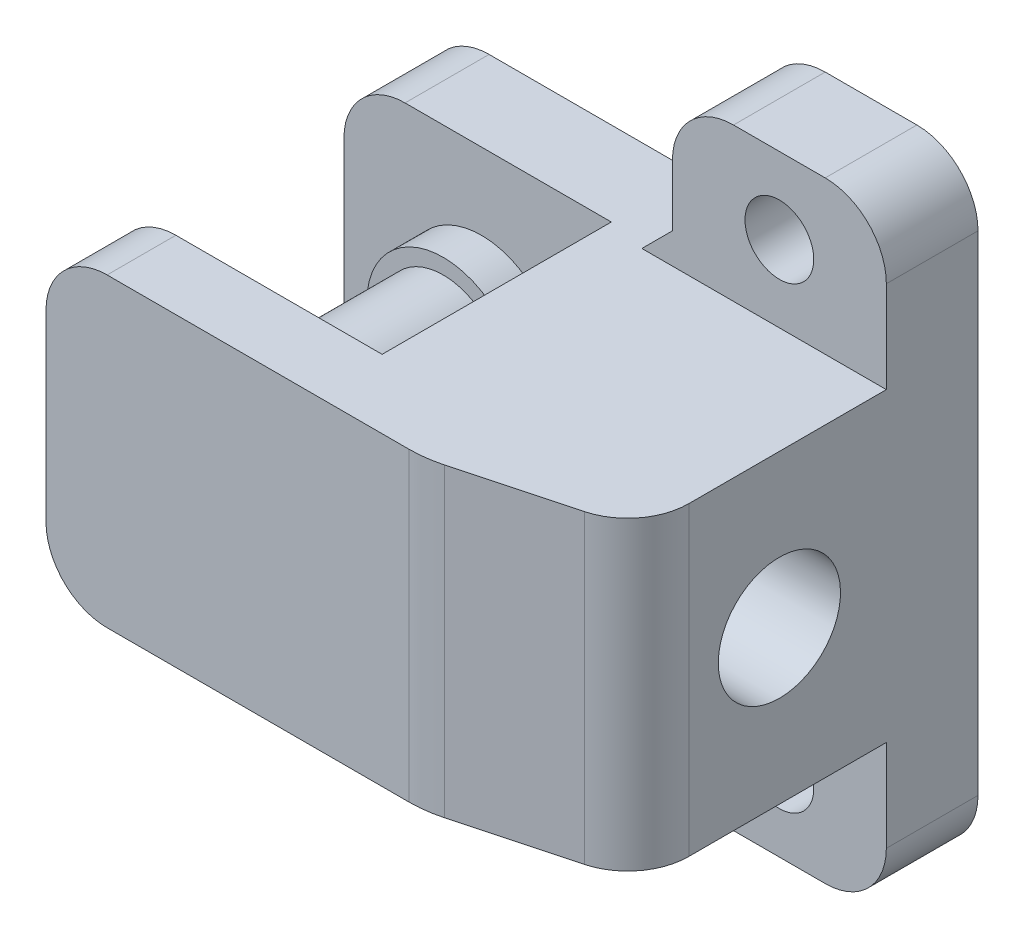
ISO-10303-21;
HEADER;
FILE_DESCRIPTION(('STEP AP214'),'2;1');
FILE_NAME('part.step','',(''),(''),'','','');
FILE_SCHEMA(('AUTOMOTIVE_DESIGN { 1 0 10303 214 1 1 1 1 }'));
ENDSEC;
DATA;
#1=APPLICATION_CONTEXT('core data for automotive mechanical design processes');
#2=APPLICATION_PROTOCOL_DEFINITION('international standard','automotive_design',2000,#1);
#3=PRODUCT_CONTEXT('',#1,'mechanical');
#4=PRODUCT('Part','Part','',(#3));
#5=PRODUCT_RELATED_PRODUCT_CATEGORY('part','',(#4));
#6=PRODUCT_DEFINITION_FORMATION('','',#4);
#7=PRODUCT_DEFINITION_CONTEXT('part definition',#1,'design');
#8=PRODUCT_DEFINITION('design','',#6,#7);
#9=PRODUCT_DEFINITION_SHAPE('','',#8);
#10=(LENGTH_UNIT() NAMED_UNIT(*) SI_UNIT(.MILLI.,.METRE.));
#11=(NAMED_UNIT(*) PLANE_ANGLE_UNIT() SI_UNIT($,.RADIAN.));
#12=(NAMED_UNIT(*) SI_UNIT($,.STERADIAN.) SOLID_ANGLE_UNIT());
#13=UNCERTAINTY_MEASURE_WITH_UNIT(LENGTH_MEASURE(1.E-05),#10,'distance_accuracy_value','');
#14=(GEOMETRIC_REPRESENTATION_CONTEXT(3) GLOBAL_UNCERTAINTY_ASSIGNED_CONTEXT((#13)) GLOBAL_UNIT_ASSIGNED_CONTEXT((#10,
#11,#12)) REPRESENTATION_CONTEXT('',''));
#15=CARTESIAN_POINT('',(0.,0.,0.));
#16=DIRECTION('',(0.,0.,1.));
#17=DIRECTION('',(1.,0.,0.));
#18=AXIS2_PLACEMENT_3D('',#15,#16,#17);
#19=CARTESIAN_POINT('',(-20.,15.,8.));
#20=DIRECTION('',(0.,0.,-1.));
#21=DIRECTION('',(-1.,0.,0.));
#22=AXIS2_PLACEMENT_3D('',#19,#20,#21);
#23=CYLINDRICAL_SURFACE('',#22,4.);
#24=CARTESIAN_POINT('',(-20.,15.,18.));
#25=DIRECTION('',(0.,0.,-1.));
#26=DIRECTION('',(-1.,0.,0.));
#27=AXIS2_PLACEMENT_3D('',#24,#25,#26);
#28=CIRCLE('',#27,4.);
#29=CARTESIAN_POINT('',(-24.,15.,18.));
#30=VERTEX_POINT('',#29);
#31=EDGE_CURVE('E18',#30,#30,#28,.F.);
#32=ORIENTED_EDGE('',*,*,#31,.F.);
#33=EDGE_LOOP('',(#32));
#34=FACE_BOUND('',#33,.T.);
#35=CARTESIAN_POINT('',(-20.,15.,8.));
#36=DIRECTION('',(0.,0.,-1.));
#37=DIRECTION('',(-1.,0.,0.));
#38=AXIS2_PLACEMENT_3D('',#35,#36,#37);
#39=CIRCLE('',#38,4.);
#40=CARTESIAN_POINT('',(-24.,15.,8.));
#41=VERTEX_POINT('',#40);
#42=EDGE_CURVE('E225',#41,#41,#39,.T.);
#43=ORIENTED_EDGE('',*,*,#42,.F.);
#44=EDGE_LOOP('',(#43));
#45=FACE_BOUND('',#44,.T.);
#46=ADVANCED_FACE('F14',(#34,#45),#23,.T.);
#47=CARTESIAN_POINT('',(-20.,15.,18.));
#48=DIRECTION('',(0.,0.,1.));
#49=DIRECTION('',(1.,0.,0.));
#50=AXIS2_PLACEMENT_3D('',#47,#48,#49);
#51=PLANE('',#50);
#52=ORIENTED_EDGE('',*,*,#31,.T.);
#53=EDGE_LOOP('',(#52));
#54=FACE_BOUND('',#53,.T.);
#55=CARTESIAN_POINT('',(-20.,15.,18.));
#56=DIRECTION('',(0.,0.,-1.));
#57=DIRECTION('',(-1.,0.,0.));
#58=AXIS2_PLACEMENT_3D('',#55,#56,#57);
#59=CIRCLE('',#58,5.);
#60=CARTESIAN_POINT('',(-25.,15.,18.));
#61=VERTEX_POINT('',#60);
#62=EDGE_CURVE('E355',#61,#61,#59,.F.);
#63=ORIENTED_EDGE('',*,*,#62,.F.);
#64=EDGE_LOOP('',(#63));
#65=FACE_BOUND('',#64,.T.);
#66=ADVANCED_FACE('F930',(#54,#65),#51,.F.);
#67=CARTESIAN_POINT('',(-7.,27.,6.));
#68=DIRECTION('',(-1.,0.,0.));
#69=DIRECTION('',(0.,-1.,0.));
#70=AXIS2_PLACEMENT_3D('',#67,#68,#69);
#71=PLANE('',#70);
#72=DIRECTION('',(0.,1.,0.));
#73=VECTOR('',#72,1.);
#74=CARTESIAN_POINT('',(-7.,5.,0.));
#75=LINE('',#74,#73);
#76=CARTESIAN_POINT('',(-7.,27.,0.));
#77=VERTEX_POINT('',#76);
#78=CARTESIAN_POINT('',(-7.,31.,0.));
#79=VERTEX_POINT('',#78);
#80=EDGE_CURVE('E332',#77,#79,#75,.T.);
#81=ORIENTED_EDGE('',*,*,#80,.F.);
#82=DIRECTION('',(0.,0.,1.));
#83=VECTOR('',#82,1.);
#84=CARTESIAN_POINT('',(-7.,27.,6.));
#85=LINE('',#84,#83);
#86=CARTESIAN_POINT('',(-7.,27.,6.));
#87=VERTEX_POINT('',#86);
#88=EDGE_CURVE('E403',#87,#77,#85,.F.);
#89=ORIENTED_EDGE('',*,*,#88,.F.);
#90=DIRECTION('',(0.,1.,0.));
#91=VECTOR('',#90,1.);
#92=CARTESIAN_POINT('',(-7.,25.,6.));
#93=LINE('',#92,#91);
#94=CARTESIAN_POINT('',(-7.,31.,6.));
#95=VERTEX_POINT('',#94);
#96=EDGE_CURVE('E345',#95,#87,#93,.F.);
#97=ORIENTED_EDGE('',*,*,#96,.F.);
#98=DIRECTION('',(0.,0.,1.));
#99=VECTOR('',#98,1.);
#100=CARTESIAN_POINT('',(-7.,31.,3.));
#101=LINE('',#100,#99);
#102=EDGE_CURVE('E247',#79,#95,#101,.T.);
#103=ORIENTED_EDGE('',*,*,#102,.F.);
#104=EDGE_LOOP('',(#81,#89,#97,#103));
#105=FACE_BOUND('',#104,.T.);
#106=ADVANCED_FACE('F560',(#105),#71,.T.);
#107=CARTESIAN_POINT('',(-3.,31.,0.));
#108=DIRECTION('',(0.,0.,-1.));
#109=DIRECTION('',(-1.,0.,0.));
#110=AXIS2_PLACEMENT_3D('',#107,#108,#109);
#111=CYLINDRICAL_SURFACE('',#110,4.);
#112=CARTESIAN_POINT('',(-3.,31.,0.));
#113=DIRECTION('',(0.,0.,-1.));
#114=DIRECTION('',(-1.,0.,0.));
#115=AXIS2_PLACEMENT_3D('',#112,#113,#114);
#116=CIRCLE('',#115,4.);
#117=CARTESIAN_POINT('',(-3.,35.,0.));
#118=VERTEX_POINT('',#117);
#119=EDGE_CURVE('E329',#79,#118,#116,.T.);
#120=ORIENTED_EDGE('',*,*,#119,.F.);
#121=ORIENTED_EDGE('',*,*,#102,.T.);
#122=CARTESIAN_POINT('',(-3.,31.,6.));
#123=DIRECTION('',(0.,0.,-1.));
#124=DIRECTION('',(-1.,0.,0.));
#125=AXIS2_PLACEMENT_3D('',#122,#123,#124);
#126=CIRCLE('',#125,4.);
#127=CARTESIAN_POINT('',(-3.,35.,6.));
#128=VERTEX_POINT('',#127);
#129=EDGE_CURVE('E342',#128,#95,#126,.F.);
#130=ORIENTED_EDGE('',*,*,#129,.F.);
#131=DIRECTION('',(0.,0.,1.));
#132=VECTOR('',#131,1.);
#133=CARTESIAN_POINT('',(-3.,35.,6.));
#134=LINE('',#133,#132);
#135=EDGE_CURVE('E244',#118,#128,#134,.T.);
#136=ORIENTED_EDGE('',*,*,#135,.F.);
#137=EDGE_LOOP('',(#120,#121,#130,#136));
#138=FACE_BOUND('',#137,.T.);
#139=ADVANCED_FACE('F565',(#138),#111,.T.);
#140=CARTESIAN_POINT('',(7.,35.,6.));
#141=DIRECTION('',(0.,1.,0.));
#142=DIRECTION('',(-1.,0.,0.));
#143=AXIS2_PLACEMENT_3D('',#140,#141,#142);
#144=PLANE('',#143);
#145=DIRECTION('',(1.,0.,0.));
#146=VECTOR('',#145,1.);
#147=CARTESIAN_POINT('',(24.,35.,0.));
#148=LINE('',#147,#146);
#149=CARTESIAN_POINT('',(3.,35.,0.));
#150=VERTEX_POINT('',#149);
#151=EDGE_CURVE('E328',#118,#150,#148,.T.);
#152=ORIENTED_EDGE('',*,*,#151,.F.);
#153=ORIENTED_EDGE('',*,*,#135,.T.);
#154=DIRECTION('',(-1.,0.,0.));
#155=VECTOR('',#154,1.);
#156=CARTESIAN_POINT('',(-7.,35.,6.));
#157=LINE('',#156,#155);
#158=CARTESIAN_POINT('',(3.,35.,6.));
#159=VERTEX_POINT('',#158);
#160=EDGE_CURVE('E337',#159,#128,#157,.T.);
#161=ORIENTED_EDGE('',*,*,#160,.F.);
#162=DIRECTION('',(0.,0.,1.));
#163=VECTOR('',#162,1.);
#164=CARTESIAN_POINT('',(3.,35.,3.));
#165=LINE('',#164,#163);
#166=EDGE_CURVE('E236',#150,#159,#165,.T.);
#167=ORIENTED_EDGE('',*,*,#166,.F.);
#168=EDGE_LOOP('',(#152,#153,#161,#167));
#169=FACE_BOUND('',#168,.T.);
#170=ADVANCED_FACE('F568',(#169),#144,.T.);
#171=CARTESIAN_POINT('',(3.,31.,6.));
#172=DIRECTION('',(0.,0.,1.));
#173=DIRECTION('',(1.,0.,0.));
#174=AXIS2_PLACEMENT_3D('',#171,#172,#173);
#175=CYLINDRICAL_SURFACE('',#174,4.);
#176=CARTESIAN_POINT('',(3.,31.,0.));
#177=DIRECTION('',(0.,0.,1.));
#178=DIRECTION('',(1.,0.,0.));
#179=AXIS2_PLACEMENT_3D('',#176,#177,#178);
#180=CIRCLE('',#179,4.);
#181=CARTESIAN_POINT('',(7.,31.,0.));
#182=VERTEX_POINT('',#181);
#183=EDGE_CURVE('E325',#150,#182,#180,.F.);
#184=ORIENTED_EDGE('',*,*,#183,.F.);
#185=ORIENTED_EDGE('',*,*,#166,.T.);
#186=CARTESIAN_POINT('',(3.,31.,6.));
#187=DIRECTION('',(0.,0.,1.));
#188=DIRECTION('',(1.,0.,0.));
#189=AXIS2_PLACEMENT_3D('',#186,#187,#188);
#190=CIRCLE('',#189,4.);
#191=CARTESIAN_POINT('',(7.,31.,6.));
#192=VERTEX_POINT('',#191);
#193=EDGE_CURVE('E338',#192,#159,#190,.T.);
#194=ORIENTED_EDGE('',*,*,#193,.F.);
#195=DIRECTION('',(0.,0.,1.));
#196=VECTOR('',#195,1.);
#197=CARTESIAN_POINT('',(7.,31.,0.));
#198=LINE('',#197,#196);
#199=EDGE_CURVE('E237',#182,#192,#198,.T.);
#200=ORIENTED_EDGE('',*,*,#199,.F.);
#201=EDGE_LOOP('',(#184,#185,#194,#200));
#202=FACE_BOUND('',#201,.T.);
#203=ADVANCED_FACE('F900',(#202),#175,.T.);
#204=CARTESIAN_POINT('',(3.,-1.,6.));
#205=DIRECTION('',(0.,0.,1.));
#206=DIRECTION('',(1.,0.,0.));
#207=AXIS2_PLACEMENT_3D('',#204,#205,#206);
#208=CYLINDRICAL_SURFACE('',#207,4.);
#209=CARTESIAN_POINT('',(3.,-1.,0.));
#210=DIRECTION('',(0.,0.,1.));
#211=DIRECTION('',(1.,0.,0.));
#212=AXIS2_PLACEMENT_3D('',#209,#210,#211);
#213=CIRCLE('',#212,4.);
#214=CARTESIAN_POINT('',(7.,-1.,0.));
#215=VERTEX_POINT('',#214);
#216=CARTESIAN_POINT('',(3.,-5.,0.));
#217=VERTEX_POINT('',#216);
#218=EDGE_CURVE('E321',#215,#217,#213,.F.);
#219=ORIENTED_EDGE('',*,*,#218,.F.);
#220=DIRECTION('',(0.,0.,1.));
#221=VECTOR('',#220,1.);
#222=CARTESIAN_POINT('',(7.,-1.,0.));
#223=LINE('',#222,#221);
#224=CARTESIAN_POINT('',(7.,-1.,6.));
#225=VERTEX_POINT('',#224);
#226=EDGE_CURVE('E240',#225,#215,#223,.F.);
#227=ORIENTED_EDGE('',*,*,#226,.F.);
#228=CARTESIAN_POINT('',(3.,-1.,6.));
#229=DIRECTION('',(0.,0.,1.));
#230=DIRECTION('',(1.,0.,0.));
#231=AXIS2_PLACEMENT_3D('',#228,#229,#230);
#232=CIRCLE('',#231,4.);
#233=CARTESIAN_POINT('',(3.,-5.,6.));
#234=VERTEX_POINT('',#233);
#235=EDGE_CURVE('E215',#234,#225,#232,.T.);
#236=ORIENTED_EDGE('',*,*,#235,.F.);
#237=DIRECTION('',(0.,0.,1.));
#238=VECTOR('',#237,1.);
#239=CARTESIAN_POINT('',(3.,-5.,6.));
#240=LINE('',#239,#238);
#241=EDGE_CURVE('E207',#217,#234,#240,.T.);
#242=ORIENTED_EDGE('',*,*,#241,.F.);
#243=EDGE_LOOP('',(#219,#227,#236,#242));
#244=FACE_BOUND('',#243,.T.);
#245=ADVANCED_FACE('F893',(#244),#208,.T.);
#246=CARTESIAN_POINT('',(7.,-5.,6.));
#247=DIRECTION('',(0.,-1.,0.));
#248=DIRECTION('',(1.,0.,0.));
#249=AXIS2_PLACEMENT_3D('',#246,#247,#248);
#250=PLANE('',#249);
#251=DIRECTION('',(1.,0.,0.));
#252=VECTOR('',#251,1.);
#253=CARTESIAN_POINT('',(-7.,-5.,6.));
#254=LINE('',#253,#252);
#255=CARTESIAN_POINT('',(-3.,-5.,6.));
#256=VERTEX_POINT('',#255);
#257=EDGE_CURVE('E210',#256,#234,#254,.T.);
#258=ORIENTED_EDGE('',*,*,#257,.F.);
#259=DIRECTION('',(0.,0.,1.));
#260=VECTOR('',#259,1.);
#261=CARTESIAN_POINT('',(-3.,-5.,3.));
#262=LINE('',#261,#260);
#263=CARTESIAN_POINT('',(-3.,-5.,0.));
#264=VERTEX_POINT('',#263);
#265=EDGE_CURVE('E196',#264,#256,#262,.T.);
#266=ORIENTED_EDGE('',*,*,#265,.F.);
#267=DIRECTION('',(1.,0.,0.));
#268=VECTOR('',#267,1.);
#269=CARTESIAN_POINT('',(24.,-5.,0.));
#270=LINE('',#269,#268);
#271=EDGE_CURVE('E320',#217,#264,#270,.F.);
#272=ORIENTED_EDGE('',*,*,#271,.F.);
#273=ORIENTED_EDGE('',*,*,#241,.T.);
#274=EDGE_LOOP('',(#258,#266,#272,#273));
#275=FACE_BOUND('',#274,.T.);
#276=ADVANCED_FACE('F211',(#275),#250,.T.);
#277=CARTESIAN_POINT('',(-3.,-1.,0.));
#278=DIRECTION('',(0.,0.,-1.));
#279=DIRECTION('',(-1.,0.,0.));
#280=AXIS2_PLACEMENT_3D('',#277,#278,#279);
#281=CYLINDRICAL_SURFACE('',#280,4.);
#282=CARTESIAN_POINT('',(-3.,-1.,0.));
#283=DIRECTION('',(0.,0.,-1.));
#284=DIRECTION('',(-1.,0.,0.));
#285=AXIS2_PLACEMENT_3D('',#282,#283,#284);
#286=CIRCLE('',#285,4.);
#287=CARTESIAN_POINT('',(-7.,-1.,0.));
#288=VERTEX_POINT('',#287);
#289=EDGE_CURVE('E203',#264,#288,#286,.T.);
#290=ORIENTED_EDGE('',*,*,#289,.F.);
#291=ORIENTED_EDGE('',*,*,#265,.T.);
#292=CARTESIAN_POINT('',(-3.,-1.,6.));
#293=DIRECTION('',(0.,0.,-1.));
#294=DIRECTION('',(-1.,0.,0.));
#295=AXIS2_PLACEMENT_3D('',#292,#293,#294);
#296=CIRCLE('',#295,4.);
#297=CARTESIAN_POINT('',(-7.,-1.,6.));
#298=VERTEX_POINT('',#297);
#299=EDGE_CURVE('E200',#298,#256,#296,.F.);
#300=ORIENTED_EDGE('',*,*,#299,.F.);
#301=DIRECTION('',(0.,0.,1.));
#302=VECTOR('',#301,1.);
#303=CARTESIAN_POINT('',(-7.,-1.,6.));
#304=LINE('',#303,#302);
#305=EDGE_CURVE('E191',#288,#298,#304,.T.);
#306=ORIENTED_EDGE('',*,*,#305,.F.);
#307=EDGE_LOOP('',(#290,#291,#300,#306));
#308=FACE_BOUND('',#307,.T.);
#309=ADVANCED_FACE('F198',(#308),#281,.T.);
#310=CARTESIAN_POINT('',(-7.,3.,6.));
#311=DIRECTION('',(-1.,0.,0.));
#312=DIRECTION('',(0.,-1.,0.));
#313=AXIS2_PLACEMENT_3D('',#310,#311,#312);
#314=PLANE('',#313);
#315=DIRECTION('',(0.,1.,0.));
#316=VECTOR('',#315,1.);
#317=CARTESIAN_POINT('',(-7.,5.,6.));
#318=LINE('',#317,#316);
#319=CARTESIAN_POINT('',(-7.,3.,6.));
#320=VERTEX_POINT('',#319);
#321=EDGE_CURVE('E219',#320,#298,#318,.F.);
#322=ORIENTED_EDGE('',*,*,#321,.F.);
#323=DIRECTION('',(0.,0.,1.));
#324=VECTOR('',#323,1.);
#325=CARTESIAN_POINT('',(-7.,3.,6.));
#326=LINE('',#325,#324);
#327=CARTESIAN_POINT('',(-7.,3.,0.));
#328=VERTEX_POINT('',#327);
#329=EDGE_CURVE('E227',#328,#320,#326,.T.);
#330=ORIENTED_EDGE('',*,*,#329,.F.);
#331=DIRECTION('',(0.,1.,0.));
#332=VECTOR('',#331,1.);
#333=CARTESIAN_POINT('',(-7.,5.,0.));
#334=LINE('',#333,#332);
#335=EDGE_CURVE('E319',#288,#328,#334,.T.);
#336=ORIENTED_EDGE('',*,*,#335,.F.);
#337=ORIENTED_EDGE('',*,*,#305,.T.);
#338=EDGE_LOOP('',(#322,#330,#336,#337));
#339=FACE_BOUND('',#338,.T.);
#340=ADVANCED_FACE('F600',(#339),#314,.T.);
#341=CARTESIAN_POINT('',(0.,0.,6.));
#342=DIRECTION('',(0.,0.,-1.));
#343=DIRECTION('',(-1.,0.,0.));
#344=AXIS2_PLACEMENT_3D('',#341,#342,#343);
#345=CYLINDRICAL_SURFACE('',#344,2.25);
#346=CARTESIAN_POINT('',(0.,0.,6.));
#347=DIRECTION('',(0.,0.,-1.));
#348=DIRECTION('',(-1.,0.,0.));
#349=AXIS2_PLACEMENT_3D('',#346,#347,#348);
#350=CIRCLE('',#349,2.25);
#351=CARTESIAN_POINT('',(-2.25,0.,6.));
#352=VERTEX_POINT('',#351);
#353=EDGE_CURVE('E358',#352,#352,#350,.T.);
#354=ORIENTED_EDGE('',*,*,#353,.F.);
#355=EDGE_LOOP('',(#354));
#356=FACE_BOUND('',#355,.T.);
#357=CARTESIAN_POINT('',(0.,0.,0.));
#358=DIRECTION('',(0.,0.,-1.));
#359=DIRECTION('',(-1.,0.,0.));
#360=AXIS2_PLACEMENT_3D('',#357,#358,#359);
#361=CIRCLE('',#360,2.25);
#362=CARTESIAN_POINT('',(-2.25,0.,0.));
#363=VERTEX_POINT('',#362);
#364=EDGE_CURVE('E314',#363,#363,#361,.F.);
#365=ORIENTED_EDGE('',*,*,#364,.F.);
#366=EDGE_LOOP('',(#365));
#367=FACE_BOUND('',#366,.T.);
#368=ADVANCED_FACE('F602',(#356,#367),#345,.F.);
#369=CARTESIAN_POINT('',(0.,30.,6.));
#370=DIRECTION('',(0.,0.,-1.));
#371=DIRECTION('',(-1.,0.,0.));
#372=AXIS2_PLACEMENT_3D('',#369,#370,#371);
#373=CYLINDRICAL_SURFACE('',#372,2.25);
#374=CARTESIAN_POINT('',(0.,30.,6.));
#375=DIRECTION('',(0.,0.,-1.));
#376=DIRECTION('',(-1.,0.,0.));
#377=AXIS2_PLACEMENT_3D('',#374,#375,#376);
#378=CIRCLE('',#377,2.25);
#379=CARTESIAN_POINT('',(-2.25,30.,6.));
#380=VERTEX_POINT('',#379);
#381=EDGE_CURVE('E333',#380,#380,#378,.T.);
#382=ORIENTED_EDGE('',*,*,#381,.F.);
#383=EDGE_LOOP('',(#382));
#384=FACE_BOUND('',#383,.T.);
#385=CARTESIAN_POINT('',(0.,30.,0.));
#386=DIRECTION('',(0.,0.,-1.));
#387=DIRECTION('',(-1.,0.,0.));
#388=AXIS2_PLACEMENT_3D('',#385,#386,#387);
#389=CIRCLE('',#388,2.25);
#390=CARTESIAN_POINT('',(-2.25,30.,0.));
#391=VERTEX_POINT('',#390);
#392=EDGE_CURVE('E310',#391,#391,#389,.F.);
#393=ORIENTED_EDGE('',*,*,#392,.F.);
#394=EDGE_LOOP('',(#393));
#395=FACE_BOUND('',#394,.T.);
#396=ADVANCED_FACE('F610',(#384,#395),#373,.F.);
#397=CARTESIAN_POINT('',(-20.,15.,8.));
#398=DIRECTION('',(0.,0.,1.));
#399=DIRECTION('',(1.,0.,0.));
#400=AXIS2_PLACEMENT_3D('',#397,#398,#399);
#401=PLANE('',#400);
#402=ORIENTED_EDGE('',*,*,#42,.T.);
#403=EDGE_LOOP('',(#402));
#404=FACE_BOUND('',#403,.T.);
#405=CARTESIAN_POINT('',(-20.,15.,8.));
#406=DIRECTION('',(0.,0.,-1.));
#407=DIRECTION('',(-1.,0.,0.));
#408=AXIS2_PLACEMENT_3D('',#405,#406,#407);
#409=CIRCLE('',#408,5.);
#410=CARTESIAN_POINT('',(-25.,15.,8.));
#411=VERTEX_POINT('',#410);
#412=EDGE_CURVE('E300',#411,#411,#409,.T.);
#413=ORIENTED_EDGE('',*,*,#412,.F.);
#414=EDGE_LOOP('',(#413));
#415=FACE_BOUND('',#414,.T.);
#416=ADVANCED_FACE('F692',(#404,#415),#401,.T.);
#417=CARTESIAN_POINT('',(-7.,3.,6.));
#418=DIRECTION('',(-0.707106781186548,-0.707106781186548,0.));
#419=DIRECTION('',(0.707106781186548,-0.707106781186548,0.));
#420=AXIS2_PLACEMENT_3D('',#417,#418,#419);
#421=PLANE('',#420);
#422=DIRECTION('',(0.707106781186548,-0.707106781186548,0.));
#423=VECTOR('',#422,1.);
#424=CARTESIAN_POINT('',(-9.,5.,6.));
#425=LINE('',#424,#423);
#426=CARTESIAN_POINT('',(-9.,5.,6.));
#427=VERTEX_POINT('',#426);
#428=EDGE_CURVE('E221',#427,#320,#425,.T.);
#429=ORIENTED_EDGE('',*,*,#428,.F.);
#430=DIRECTION('',(0.,0.,1.));
#431=VECTOR('',#430,1.);
#432=CARTESIAN_POINT('',(-9.,5.,25.));
#433=LINE('',#432,#431);
#434=CARTESIAN_POINT('',(-9.,5.,0.));
#435=VERTEX_POINT('',#434);
#436=EDGE_CURVE('E383',#435,#427,#433,.T.);
#437=ORIENTED_EDGE('',*,*,#436,.F.);
#438=DIRECTION('',(-0.707106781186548,0.707106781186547,0.));
#439=VECTOR('',#438,1.);
#440=CARTESIAN_POINT('',(-7.,3.,0.));
#441=LINE('',#440,#439);
#442=EDGE_CURVE('E398',#328,#435,#441,.T.);
#443=ORIENTED_EDGE('',*,*,#442,.F.);
#444=ORIENTED_EDGE('',*,*,#329,.T.);
#445=EDGE_LOOP('',(#429,#437,#443,#444));
#446=FACE_BOUND('',#445,.T.);
#447=ADVANCED_FACE('F599',(#446),#421,.T.);
#448=CARTESIAN_POINT('',(-7.,5.,6.));
#449=DIRECTION('',(0.,0.,1.));
#450=DIRECTION('',(1.,0.,0.));
#451=AXIS2_PLACEMENT_3D('',#448,#449,#450);
#452=PLANE('',#451);
#453=ORIENTED_EDGE('',*,*,#353,.T.);
#454=EDGE_LOOP('',(#453));
#455=FACE_BOUND('',#454,.T.);
#456=ORIENTED_EDGE('',*,*,#235,.T.);
#457=DIRECTION('',(0.,-1.,0.));
#458=VECTOR('',#457,1.);
#459=CARTESIAN_POINT('',(7.,5.,6.));
#460=LINE('',#459,#458);
#461=CARTESIAN_POINT('',(7.,5.,6.));
#462=VERTEX_POINT('',#461);
#463=EDGE_CURVE('E346',#462,#225,#460,.T.);
#464=ORIENTED_EDGE('',*,*,#463,.F.);
#465=DIRECTION('',(-1.,0.,0.));
#466=VECTOR('',#465,1.);
#467=CARTESIAN_POINT('',(24.,5.,6.));
#468=LINE('',#467,#466);
#469=EDGE_CURVE('E381',#427,#462,#468,.F.);
#470=ORIENTED_EDGE('',*,*,#469,.F.);
#471=ORIENTED_EDGE('',*,*,#428,.T.);
#472=ORIENTED_EDGE('',*,*,#321,.T.);
#473=ORIENTED_EDGE('',*,*,#299,.T.);
#474=ORIENTED_EDGE('',*,*,#257,.T.);
#475=EDGE_LOOP('',(#456,#464,#470,#471,#472,#473,#474));
#476=FACE_BOUND('',#475,.T.);
#477=ADVANCED_FACE('F217',(#455,#476),#452,.T.);
#478=CARTESIAN_POINT('',(-29.,25.,0.));
#479=DIRECTION('',(-1.,0.,0.));
#480=DIRECTION('',(0.,-1.,0.));
#481=AXIS2_PLACEMENT_3D('',#478,#479,#480);
#482=PLANE('',#481);
#483=DIRECTION('',(0.,1.,0.));
#484=VECTOR('',#483,1.);
#485=CARTESIAN_POINT('',(-29.,5.,25.));
#486=LINE('',#485,#484);
#487=CARTESIAN_POINT('',(-29.,21.,25.));
#488=VERTEX_POINT('',#487);
#489=CARTESIAN_POINT('',(-29.,9.,25.));
#490=VERTEX_POINT('',#489);
#491=EDGE_CURVE('E350',#488,#490,#486,.F.);
#492=ORIENTED_EDGE('',*,*,#491,.F.);
#493=DIRECTION('',(0.,0.,1.));
#494=VECTOR('',#493,1.);
#495=CARTESIAN_POINT('',(-29.,21.,22.75));
#496=LINE('',#495,#494);
#497=CARTESIAN_POINT('',(-29.,21.,20.5));
#498=VERTEX_POINT('',#497);
#499=EDGE_CURVE('E354',#498,#488,#496,.T.);
#500=ORIENTED_EDGE('',*,*,#499,.F.);
#501=DIRECTION('',(0.,1.,0.));
#502=VECTOR('',#501,1.);
#503=CARTESIAN_POINT('',(-29.,25.,20.5));
#504=LINE('',#503,#502);
#505=CARTESIAN_POINT('',(-29.,9.,20.5));
#506=VERTEX_POINT('',#505);
#507=EDGE_CURVE('E286',#506,#498,#504,.T.);
#508=ORIENTED_EDGE('',*,*,#507,.F.);
#509=DIRECTION('',(0.,0.,-1.));
#510=VECTOR('',#509,1.);
#511=CARTESIAN_POINT('',(-29.,9.,22.75));
#512=LINE('',#511,#510);
#513=EDGE_CURVE('E357',#490,#506,#512,.T.);
#514=ORIENTED_EDGE('',*,*,#513,.F.);
#515=EDGE_LOOP('',(#492,#500,#508,#514));
#516=FACE_BOUND('',#515,.T.);
#517=ADVANCED_FACE('F588',(#516),#482,.T.);
#518=CARTESIAN_POINT('',(-25.,9.,25.));
#519=DIRECTION('',(0.,0.,1.));
#520=DIRECTION('',(1.,0.,0.));
#521=AXIS2_PLACEMENT_3D('',#518,#519,#520);
#522=CYLINDRICAL_SURFACE('',#521,4.);
#523=CARTESIAN_POINT('',(-25.,9.,20.5));
#524=DIRECTION('',(0.,0.,1.));
#525=DIRECTION('',(1.,0.,0.));
#526=AXIS2_PLACEMENT_3D('',#523,#524,#525);
#527=CIRCLE('',#526,4.);
#528=CARTESIAN_POINT('',(-25.,5.,20.5));
#529=VERTEX_POINT('',#528);
#530=EDGE_CURVE('E280',#529,#506,#527,.F.);
#531=ORIENTED_EDGE('',*,*,#530,.F.);
#532=DIRECTION('',(0.,0.,1.));
#533=VECTOR('',#532,1.);
#534=CARTESIAN_POINT('',(-25.,5.,25.));
#535=LINE('',#534,#533);
#536=CARTESIAN_POINT('',(-25.,5.,25.));
#537=VERTEX_POINT('',#536);
#538=EDGE_CURVE('E443',#537,#529,#535,.F.);
#539=ORIENTED_EDGE('',*,*,#538,.F.);
#540=CARTESIAN_POINT('',(-25.,9.,25.));
#541=DIRECTION('',(0.,0.,1.));
#542=DIRECTION('',(1.,0.,0.));
#543=AXIS2_PLACEMENT_3D('',#540,#541,#542);
#544=CIRCLE('',#543,4.);
#545=EDGE_CURVE('E347',#490,#537,#544,.T.);
#546=ORIENTED_EDGE('',*,*,#545,.F.);
#547=ORIENTED_EDGE('',*,*,#513,.T.);
#548=EDGE_LOOP('',(#531,#539,#546,#547));
#549=FACE_BOUND('',#548,.T.);
#550=ADVANCED_FACE('F590',(#549),#522,.T.);
#551=CARTESIAN_POINT('',(-20.,15.,18.));
#552=DIRECTION('',(0.,0.,-1.));
#553=DIRECTION('',(-1.,0.,0.));
#554=AXIS2_PLACEMENT_3D('',#551,#552,#553);
#555=CYLINDRICAL_SURFACE('',#554,5.);
#556=ORIENTED_EDGE('',*,*,#62,.T.);
#557=EDGE_LOOP('',(#556));
#558=FACE_BOUND('',#557,.T.);
#559=CARTESIAN_POINT('',(-20.,15.,20.5));
#560=DIRECTION('',(0.,0.,-1.));
#561=DIRECTION('',(-1.,0.,0.));
#562=AXIS2_PLACEMENT_3D('',#559,#560,#561);
#563=CIRCLE('',#562,5.);
#564=CARTESIAN_POINT('',(-25.,15.,20.5));
#565=VERTEX_POINT('',#564);
#566=EDGE_CURVE('E276',#565,#565,#563,.F.);
#567=ORIENTED_EDGE('',*,*,#566,.F.);
#568=EDGE_LOOP('',(#567));
#569=FACE_BOUND('',#568,.T.);
#570=ADVANCED_FACE('F680',(#558,#569),#555,.T.);
#571=CARTESIAN_POINT('',(-25.,21.,20.5));
#572=DIRECTION('',(0.,0.,-1.));
#573=DIRECTION('',(-1.,0.,0.));
#574=AXIS2_PLACEMENT_3D('',#571,#572,#573);
#575=CYLINDRICAL_SURFACE('',#574,4.);
#576=CARTESIAN_POINT('',(-25.,21.,25.));
#577=DIRECTION('',(0.,0.,-1.));
#578=DIRECTION('',(-1.,0.,0.));
#579=AXIS2_PLACEMENT_3D('',#576,#577,#578);
#580=CIRCLE('',#579,4.);
#581=CARTESIAN_POINT('',(-25.,25.,25.));
#582=VERTEX_POINT('',#581);
#583=EDGE_CURVE('E351',#582,#488,#580,.F.);
#584=ORIENTED_EDGE('',*,*,#583,.F.);
#585=DIRECTION('',(0.,0.,1.));
#586=VECTOR('',#585,1.);
#587=CARTESIAN_POINT('',(-25.,25.,25.));
#588=LINE('',#587,#586);
#589=CARTESIAN_POINT('',(-25.,25.,20.5));
#590=VERTEX_POINT('',#589);
#591=EDGE_CURVE('E431',#590,#582,#588,.T.);
#592=ORIENTED_EDGE('',*,*,#591,.F.);
#593=CARTESIAN_POINT('',(-25.,21.,20.5));
#594=DIRECTION('',(0.,0.,-1.));
#595=DIRECTION('',(-1.,0.,0.));
#596=AXIS2_PLACEMENT_3D('',#593,#594,#595);
#597=CIRCLE('',#596,4.);
#598=EDGE_CURVE('E284',#498,#590,#597,.T.);
#599=ORIENTED_EDGE('',*,*,#598,.F.);
#600=ORIENTED_EDGE('',*,*,#499,.T.);
#601=EDGE_LOOP('',(#584,#592,#599,#600));
#602=FACE_BOUND('',#601,.T.);
#603=ADVANCED_FACE('F532',(#602),#575,.T.);
#604=CARTESIAN_POINT('',(24.,5.,25.));
#605=DIRECTION('',(0.,0.,-1.));
#606=DIRECTION('',(-1.,0.,0.));
#607=AXIS2_PLACEMENT_3D('',#604,#605,#606);
#608=PLANE('',#607);
#609=DIRECTION('',(-1.,0.,0.));
#610=VECTOR('',#609,1.);
#611=CARTESIAN_POINT('',(24.,5.,25.));
#612=LINE('',#611,#610);
#613=CARTESIAN_POINT('',(-5.249372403,4.99999999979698,25.));
#614=VERTEX_POINT('',#613);
#615=EDGE_CURVE('E290',#614,#537,#612,.T.);
#616=ORIENTED_EDGE('',*,*,#615,.F.);
#617=DIRECTION('',(0.,-1.,0.));
#618=VECTOR('',#617,1.);
#619=CARTESIAN_POINT('',(-5.249372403,15.,25.));
#620=LINE('',#619,#618);
#621=CARTESIAN_POINT('',(-5.249372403,25.0000000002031,25.));
#622=VERTEX_POINT('',#621);
#623=EDGE_CURVE('E349',#622,#614,#620,.T.);
#624=ORIENTED_EDGE('',*,*,#623,.F.);
#625=DIRECTION('',(1.,0.,0.));
#626=VECTOR('',#625,1.);
#627=CARTESIAN_POINT('',(24.,25.,25.));
#628=LINE('',#627,#626);
#629=EDGE_CURVE('E275',#582,#622,#628,.T.);
#630=ORIENTED_EDGE('',*,*,#629,.F.);
#631=ORIENTED_EDGE('',*,*,#583,.T.);
#632=ORIENTED_EDGE('',*,*,#491,.T.);
#633=ORIENTED_EDGE('',*,*,#545,.T.);
#634=EDGE_LOOP('',(#616,#624,#630,#631,#632,#633));
#635=FACE_BOUND('',#634,.T.);
#636=ADVANCED_FACE('F537',(#635),#608,.F.);
#637=CARTESIAN_POINT('',(-5.249372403,25.,17.));
#638=DIRECTION('',(0.,1.,0.));
#639=DIRECTION('',(0.,0.,1.));
#640=AXIS2_PLACEMENT_3D('',#637,#638,#639);
#641=CYLINDRICAL_SURFACE('',#640,8.);
#642=CARTESIAN_POINT('',(-5.249372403,25.0000000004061,17.));
#643=DIRECTION('',(0.,1.,0.));
#644=DIRECTION('',(0.,0.,1.));
#645=AXIS2_PLACEMENT_3D('',#642,#643,#644);
#646=CIRCLE('',#645,8.);
#647=CARTESIAN_POINT('',(-3.1788200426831,25.0000000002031,24.727406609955));
#648=VERTEX_POINT('',#647);
#649=EDGE_CURVE('E272',#622,#648,#646,.T.);
#650=ORIENTED_EDGE('',*,*,#649,.F.);
#651=ORIENTED_EDGE('',*,*,#623,.T.);
#652=CARTESIAN_POINT('',(-5.249372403,4.99999999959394,17.));
#653=DIRECTION('',(0.,1.,0.));
#654=DIRECTION('',(0.,0.,1.));
#655=AXIS2_PLACEMENT_3D('',#652,#653,#654);
#656=CIRCLE('',#655,8.);
#657=CARTESIAN_POINT('',(-3.1788200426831,4.99999999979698,24.727406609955));
#658=VERTEX_POINT('',#657);
#659=EDGE_CURVE('E287',#658,#614,#656,.F.);
#660=ORIENTED_EDGE('',*,*,#659,.F.);
#661=DIRECTION('',(0.,1.,0.));
#662=VECTOR('',#661,1.);
#663=CARTESIAN_POINT('',(-3.17882004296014,5.,24.7274066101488));
#664=LINE('',#663,#662);
#665=EDGE_CURVE('E428',#648,#658,#664,.F.);
#666=ORIENTED_EDGE('',*,*,#665,.F.);
#667=EDGE_LOOP('',(#650,#651,#660,#666));
#668=FACE_BOUND('',#667,.T.);
#669=ADVANCED_FACE('F541',(#668),#641,.T.);
#670=CARTESIAN_POINT('',(7.,5.,22.));
#671=DIRECTION('',(-0.258819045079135,0.,-0.965925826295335));
#672=DIRECTION('',(-0.965925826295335,0.,0.258819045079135));
#673=AXIS2_PLACEMENT_3D('',#670,#671,#672);
#674=PLANE('',#673);
#675=DIRECTION('',(0.965925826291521,0.,-0.258819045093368));
#676=VECTOR('',#675,1.);
#677=CARTESIAN_POINT('',(-3.178820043,25.,24.72740661));
#678=LINE('',#677,#676);
#679=CARTESIAN_POINT('',(4.03527618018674,25.,22.794395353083));
#680=VERTEX_POINT('',#679);
#681=EDGE_CURVE('E271',#648,#680,#678,.T.);
#682=ORIENTED_EDGE('',*,*,#681,.F.);
#683=ORIENTED_EDGE('',*,*,#665,.T.);
#684=DIRECTION('',(-0.965925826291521,0.,0.258819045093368));
#685=VECTOR('',#684,1.);
#686=CARTESIAN_POINT('',(4.03527618,5.,22.794395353));
#687=LINE('',#686,#685);
#688=CARTESIAN_POINT('',(4.03527618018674,5.,22.794395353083));
#689=VERTEX_POINT('',#688);
#690=EDGE_CURVE('E291',#689,#658,#687,.T.);
#691=ORIENTED_EDGE('',*,*,#690,.F.);
#692=DIRECTION('',(0.,-1.,0.));
#693=VECTOR('',#692,1.);
#694=CARTESIAN_POINT('',(4.03527618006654,15.,22.7943953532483));
#695=LINE('',#694,#693);
#696=EDGE_CURVE('E242',#680,#689,#695,.T.);
#697=ORIENTED_EDGE('',*,*,#696,.F.);
#698=EDGE_LOOP('',(#682,#683,#691,#697));
#699=FACE_BOUND('',#698,.T.);
#700=ADVANCED_FACE('F545',(#699),#674,.F.);
#701=CARTESIAN_POINT('',(3.,25.,18.930692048));
#702=DIRECTION('',(0.,1.,0.));
#703=DIRECTION('',(0.,0.,1.));
#704=AXIS2_PLACEMENT_3D('',#701,#702,#703);
#705=CYLINDRICAL_SURFACE('',#704,4.);
#706=CARTESIAN_POINT('',(3.,25.,18.930692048));
#707=DIRECTION('',(0.,1.,0.));
#708=DIRECTION('',(0.,0.,1.));
#709=AXIS2_PLACEMENT_3D('',#706,#707,#708);
#710=CIRCLE('',#709,4.);
#711=CARTESIAN_POINT('',(7.,25.,18.930692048));
#712=VERTEX_POINT('',#711);
#713=EDGE_CURVE('E267',#680,#712,#710,.T.);
#714=ORIENTED_EDGE('',*,*,#713,.F.);
#715=ORIENTED_EDGE('',*,*,#696,.T.);
#716=CARTESIAN_POINT('',(3.,5.,18.930692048));
#717=DIRECTION('',(0.,1.,0.));
#718=DIRECTION('',(0.,0.,1.));
#719=AXIS2_PLACEMENT_3D('',#716,#717,#718);
#720=CIRCLE('',#719,4.);
#721=CARTESIAN_POINT('',(7.,5.,18.930692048));
#722=VERTEX_POINT('',#721);
#723=EDGE_CURVE('E292',#722,#689,#720,.F.);
#724=ORIENTED_EDGE('',*,*,#723,.F.);
#725=DIRECTION('',(0.,-1.,0.));
#726=VECTOR('',#725,1.);
#727=CARTESIAN_POINT('',(7.,5.,18.930692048));
#728=LINE('',#727,#726);
#729=EDGE_CURVE('E239',#712,#722,#728,.T.);
#730=ORIENTED_EDGE('',*,*,#729,.F.);
#731=EDGE_LOOP('',(#714,#715,#724,#730));
#732=FACE_BOUND('',#731,.T.);
#733=ADVANCED_FACE('F549',(#732),#705,.T.);
#734=CARTESIAN_POINT('',(7.,5.,0.));
#735=DIRECTION('',(-1.,0.,0.));
#736=DIRECTION('',(0.,-1.,0.));
#737=AXIS2_PLACEMENT_3D('',#734,#735,#736);
#738=PLANE('',#737);
#739=CARTESIAN_POINT('',(7.,15.,13.));
#740=DIRECTION('',(-1.,0.,0.));
#741=DIRECTION('',(0.,-1.,0.));
#742=AXIS2_PLACEMENT_3D('',#739,#740,#741);
#743=CIRCLE('',#742,4.);
#744=CARTESIAN_POINT('',(7.,11.,13.));
#745=VERTEX_POINT('',#744);
#746=EDGE_CURVE('E296',#745,#745,#743,.F.);
#747=ORIENTED_EDGE('',*,*,#746,.F.);
#748=EDGE_LOOP('',(#747));
#749=FACE_BOUND('',#748,.T.);
#750=DIRECTION('',(0.,0.,1.));
#751=VECTOR('',#750,1.);
#752=CARTESIAN_POINT('',(7.,5.,25.));
#753=LINE('',#752,#751);
#754=EDGE_CURVE('E295',#462,#722,#753,.T.);
#755=ORIENTED_EDGE('',*,*,#754,.F.);
#756=ORIENTED_EDGE('',*,*,#463,.T.);
#757=ORIENTED_EDGE('',*,*,#226,.T.);
#758=DIRECTION('',(0.,1.,0.));
#759=VECTOR('',#758,1.);
#760=CARTESIAN_POINT('',(7.,5.,0.));
#761=LINE('',#760,#759);
#762=EDGE_CURVE('E324',#182,#215,#761,.F.);
#763=ORIENTED_EDGE('',*,*,#762,.F.);
#764=ORIENTED_EDGE('',*,*,#199,.T.);
#765=DIRECTION('',(0.,1.,0.));
#766=VECTOR('',#765,1.);
#767=CARTESIAN_POINT('',(7.,25.,6.));
#768=LINE('',#767,#766);
#769=CARTESIAN_POINT('',(7.,25.,6.));
#770=VERTEX_POINT('',#769);
#771=EDGE_CURVE('E341',#770,#192,#768,.T.);
#772=ORIENTED_EDGE('',*,*,#771,.F.);
#773=DIRECTION('',(0.,0.,1.));
#774=VECTOR('',#773,1.);
#775=CARTESIAN_POINT('',(7.,25.,25.));
#776=LINE('',#775,#774);
#777=EDGE_CURVE('E270',#712,#770,#776,.F.);
#778=ORIENTED_EDGE('',*,*,#777,.F.);
#779=ORIENTED_EDGE('',*,*,#729,.T.);
#780=EDGE_LOOP('',(#755,#756,#757,#763,#764,#772,#778,#779));
#781=FACE_BOUND('',#780,.T.);
#782=ADVANCED_FACE('F369',(#749,#781),#738,.F.);
#783=CARTESIAN_POINT('',(-7.,25.,6.));
#784=DIRECTION('',(0.,0.,-1.));
#785=DIRECTION('',(-1.,0.,0.));
#786=AXIS2_PLACEMENT_3D('',#783,#784,#785);
#787=PLANE('',#786);
#788=ORIENTED_EDGE('',*,*,#381,.T.);
#789=EDGE_LOOP('',(#788));
#790=FACE_BOUND('',#789,.T.);
#791=ORIENTED_EDGE('',*,*,#193,.T.);
#792=ORIENTED_EDGE('',*,*,#160,.T.);
#793=ORIENTED_EDGE('',*,*,#129,.T.);
#794=ORIENTED_EDGE('',*,*,#96,.T.);
#795=DIRECTION('',(-0.707106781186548,-0.707106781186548,0.));
#796=VECTOR('',#795,1.);
#797=CARTESIAN_POINT('',(-7.,27.,6.));
#798=LINE('',#797,#796);
#799=CARTESIAN_POINT('',(-9.,25.,6.));
#800=VERTEX_POINT('',#799);
#801=EDGE_CURVE('E336',#800,#87,#798,.F.);
#802=ORIENTED_EDGE('',*,*,#801,.F.);
#803=DIRECTION('',(1.,0.,0.));
#804=VECTOR('',#803,1.);
#805=CARTESIAN_POINT('',(24.,25.,6.));
#806=LINE('',#805,#804);
#807=EDGE_CURVE('E421',#770,#800,#806,.F.);
#808=ORIENTED_EDGE('',*,*,#807,.F.);
#809=ORIENTED_EDGE('',*,*,#771,.T.);
#810=EDGE_LOOP('',(#791,#792,#793,#794,#802,#808,#809));
#811=FACE_BOUND('',#810,.T.);
#812=ADVANCED_FACE('F555',(#790,#811),#787,.F.);
#813=CARTESIAN_POINT('',(-7.,27.,6.));
#814=DIRECTION('',(-0.707106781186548,0.707106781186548,0.));
#815=DIRECTION('',(-0.707106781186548,-0.707106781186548,0.));
#816=AXIS2_PLACEMENT_3D('',#813,#814,#815);
#817=PLANE('',#816);
#818=ORIENTED_EDGE('',*,*,#801,.T.);
#819=ORIENTED_EDGE('',*,*,#88,.T.);
#820=DIRECTION('',(0.707106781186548,0.707106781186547,0.));
#821=VECTOR('',#820,1.);
#822=CARTESIAN_POINT('',(-9.,25.,0.));
#823=LINE('',#822,#821);
#824=CARTESIAN_POINT('',(-9.,25.,0.));
#825=VERTEX_POINT('',#824);
#826=EDGE_CURVE('E317',#825,#77,#823,.T.);
#827=ORIENTED_EDGE('',*,*,#826,.F.);
#828=DIRECTION('',(0.,0.,1.));
#829=VECTOR('',#828,1.);
#830=CARTESIAN_POINT('',(-9.,25.,25.));
#831=LINE('',#830,#829);
#832=EDGE_CURVE('E424',#800,#825,#831,.F.);
#833=ORIENTED_EDGE('',*,*,#832,.F.);
#834=EDGE_LOOP('',(#818,#819,#827,#833));
#835=FACE_BOUND('',#834,.T.);
#836=ADVANCED_FACE('F512',(#835),#817,.T.);
#837=CARTESIAN_POINT('',(24.,5.,0.));
#838=DIRECTION('',(0.,0.,1.));
#839=DIRECTION('',(1.,0.,0.));
#840=AXIS2_PLACEMENT_3D('',#837,#838,#839);
#841=PLANE('',#840);
#842=ORIENTED_EDGE('',*,*,#392,.T.);
#843=EDGE_LOOP('',(#842));
#844=FACE_BOUND('',#843,.T.);
#845=ORIENTED_EDGE('',*,*,#364,.T.);
#846=EDGE_LOOP('',(#845));
#847=FACE_BOUND('',#846,.T.);
#848=DIRECTION('',(1.,0.,0.));
#849=VECTOR('',#848,1.);
#850=CARTESIAN_POINT('',(24.,25.,0.));
#851=LINE('',#850,#849);
#852=CARTESIAN_POINT('',(-25.,25.,0.));
#853=VERTEX_POINT('',#852);
#854=EDGE_CURVE('E485',#825,#853,#851,.F.);
#855=ORIENTED_EDGE('',*,*,#854,.F.);
#856=ORIENTED_EDGE('',*,*,#826,.T.);
#857=ORIENTED_EDGE('',*,*,#80,.T.);
#858=ORIENTED_EDGE('',*,*,#119,.T.);
#859=ORIENTED_EDGE('',*,*,#151,.T.);
#860=ORIENTED_EDGE('',*,*,#183,.T.);
#861=ORIENTED_EDGE('',*,*,#762,.T.);
#862=ORIENTED_EDGE('',*,*,#218,.T.);
#863=ORIENTED_EDGE('',*,*,#271,.T.);
#864=ORIENTED_EDGE('',*,*,#289,.T.);
#865=ORIENTED_EDGE('',*,*,#335,.T.);
#866=ORIENTED_EDGE('',*,*,#442,.T.);
#867=DIRECTION('',(-1.,0.,0.));
#868=VECTOR('',#867,1.);
#869=CARTESIAN_POINT('',(24.,5.,0.));
#870=LINE('',#869,#868);
#871=CARTESIAN_POINT('',(-25.,5.,0.));
#872=VERTEX_POINT('',#871);
#873=EDGE_CURVE('E391',#872,#435,#870,.F.);
#874=ORIENTED_EDGE('',*,*,#873,.F.);
#875=CARTESIAN_POINT('',(-25.,9.,0.));
#876=DIRECTION('',(0.,0.,1.));
#877=DIRECTION('',(1.,0.,0.));
#878=AXIS2_PLACEMENT_3D('',#875,#876,#877);
#879=CIRCLE('',#878,4.);
#880=CARTESIAN_POINT('',(-29.,9.,0.));
#881=VERTEX_POINT('',#880);
#882=EDGE_CURVE('E307',#881,#872,#879,.T.);
#883=ORIENTED_EDGE('',*,*,#882,.F.);
#884=DIRECTION('',(0.,-1.,0.));
#885=VECTOR('',#884,1.);
#886=CARTESIAN_POINT('',(-29.,25.,0.));
#887=LINE('',#886,#885);
#888=CARTESIAN_POINT('',(-29.,21.,0.));
#889=VERTEX_POINT('',#888);
#890=EDGE_CURVE('E313',#889,#881,#887,.T.);
#891=ORIENTED_EDGE('',*,*,#890,.F.);
#892=CARTESIAN_POINT('',(-25.,21.,0.));
#893=DIRECTION('',(0.,0.,-1.));
#894=DIRECTION('',(-1.,0.,0.));
#895=AXIS2_PLACEMENT_3D('',#892,#893,#894);
#896=CIRCLE('',#895,4.);
#897=EDGE_CURVE('E304',#853,#889,#896,.F.);
#898=ORIENTED_EDGE('',*,*,#897,.F.);
#899=EDGE_LOOP('',(#855,#856,#857,#858,#859,#860,#861,#862,#863,#864,#865,#866,#874,#883,#891,#898));
#900=FACE_BOUND('',#899,.T.);
#901=ADVANCED_FACE('F514',(#844,#847,#900),#841,.F.);
#902=CARTESIAN_POINT('',(-29.,25.,0.));
#903=DIRECTION('',(-1.,0.,0.));
#904=DIRECTION('',(0.,-1.,0.));
#905=AXIS2_PLACEMENT_3D('',#902,#903,#904);
#906=PLANE('',#905);
#907=ORIENTED_EDGE('',*,*,#890,.T.);
#908=DIRECTION('',(0.,0.,-1.));
#909=VECTOR('',#908,1.);
#910=CARTESIAN_POINT('',(-29.,9.,2.75));
#911=LINE('',#910,#909);
#912=CARTESIAN_POINT('',(-29.,9.,5.5));
#913=VERTEX_POINT('',#912);
#914=EDGE_CURVE('E309',#913,#881,#911,.T.);
#915=ORIENTED_EDGE('',*,*,#914,.F.);
#916=DIRECTION('',(0.,1.,0.));
#917=VECTOR('',#916,1.);
#918=CARTESIAN_POINT('',(-29.,25.,5.5));
#919=LINE('',#918,#917);
#920=CARTESIAN_POINT('',(-29.,21.,5.5));
#921=VERTEX_POINT('',#920);
#922=EDGE_CURVE('E266',#921,#913,#919,.F.);
#923=ORIENTED_EDGE('',*,*,#922,.F.);
#924=DIRECTION('',(0.,0.,1.));
#925=VECTOR('',#924,1.);
#926=CARTESIAN_POINT('',(-29.,21.,2.75));
#927=LINE('',#926,#925);
#928=EDGE_CURVE('E303',#889,#921,#927,.T.);
#929=ORIENTED_EDGE('',*,*,#928,.F.);
#930=EDGE_LOOP('',(#907,#915,#923,#929));
#931=FACE_BOUND('',#930,.T.);
#932=ADVANCED_FACE('F655',(#931),#906,.T.);
#933=CARTESIAN_POINT('',(-25.,9.,5.5));
#934=DIRECTION('',(0.,0.,1.));
#935=DIRECTION('',(1.,0.,0.));
#936=AXIS2_PLACEMENT_3D('',#933,#934,#935);
#937=CYLINDRICAL_SURFACE('',#936,4.);
#938=ORIENTED_EDGE('',*,*,#882,.T.);
#939=DIRECTION('',(0.,0.,1.));
#940=VECTOR('',#939,1.);
#941=CARTESIAN_POINT('',(-25.,5.,25.));
#942=LINE('',#941,#940);
#943=CARTESIAN_POINT('',(-25.,5.,5.5));
#944=VERTEX_POINT('',#943);
#945=EDGE_CURVE('E299',#944,#872,#942,.F.);
#946=ORIENTED_EDGE('',*,*,#945,.F.);
#947=CARTESIAN_POINT('',(-25.,9.,5.5));
#948=DIRECTION('',(0.,0.,1.));
#949=DIRECTION('',(1.,0.,0.));
#950=AXIS2_PLACEMENT_3D('',#947,#948,#949);
#951=CIRCLE('',#950,4.);
#952=EDGE_CURVE('E262',#913,#944,#951,.T.);
#953=ORIENTED_EDGE('',*,*,#952,.F.);
#954=ORIENTED_EDGE('',*,*,#914,.T.);
#955=EDGE_LOOP('',(#938,#946,#953,#954));
#956=FACE_BOUND('',#955,.T.);
#957=ADVANCED_FACE('F594',(#956),#937,.T.);
#958=CARTESIAN_POINT('',(-25.,21.,0.));
#959=DIRECTION('',(0.,0.,-1.));
#960=DIRECTION('',(-1.,0.,0.));
#961=AXIS2_PLACEMENT_3D('',#958,#959,#960);
#962=CYLINDRICAL_SURFACE('',#961,4.);
#963=CARTESIAN_POINT('',(-25.,21.,5.5));
#964=DIRECTION('',(0.,0.,-1.));
#965=DIRECTION('',(-1.,0.,0.));
#966=AXIS2_PLACEMENT_3D('',#963,#964,#965);
#967=CIRCLE('',#966,4.);
#968=CARTESIAN_POINT('',(-25.,25.,5.5));
#969=VERTEX_POINT('',#968);
#970=EDGE_CURVE('E259',#969,#921,#967,.F.);
#971=ORIENTED_EDGE('',*,*,#970,.F.);
#972=DIRECTION('',(0.,0.,1.));
#973=VECTOR('',#972,1.);
#974=CARTESIAN_POINT('',(-25.,25.,25.));
#975=LINE('',#974,#973);
#976=EDGE_CURVE('E481',#853,#969,#975,.T.);
#977=ORIENTED_EDGE('',*,*,#976,.F.);
#978=ORIENTED_EDGE('',*,*,#897,.T.);
#979=ORIENTED_EDGE('',*,*,#928,.T.);
#980=EDGE_LOOP('',(#971,#977,#978,#979));
#981=FACE_BOUND('',#980,.T.);
#982=ADVANCED_FACE('F520',(#981),#962,.T.);
#983=CARTESIAN_POINT('',(-20.,15.,5.5));
#984=DIRECTION('',(0.,0.,-1.));
#985=DIRECTION('',(-1.,0.,0.));
#986=AXIS2_PLACEMENT_3D('',#983,#984,#985);
#987=CYLINDRICAL_SURFACE('',#986,5.);
#988=ORIENTED_EDGE('',*,*,#412,.T.);
#989=EDGE_LOOP('',(#988));
#990=FACE_BOUND('',#989,.T.);
#991=CARTESIAN_POINT('',(-20.,15.,5.5));
#992=DIRECTION('',(0.,0.,-1.));
#993=DIRECTION('',(-1.,0.,0.));
#994=AXIS2_PLACEMENT_3D('',#991,#992,#993);
#995=CIRCLE('',#994,5.);
#996=CARTESIAN_POINT('',(-25.,15.,5.5));
#997=VERTEX_POINT('',#996);
#998=EDGE_CURVE('E256',#997,#997,#995,.T.);
#999=ORIENTED_EDGE('',*,*,#998,.F.);
#1000=EDGE_LOOP('',(#999));
#1001=FACE_BOUND('',#1000,.T.);
#1002=ADVANCED_FACE('F646',(#990,#1001),#987,.T.);
#1003=CARTESIAN_POINT('',(7.,15.,13.));
#1004=DIRECTION('',(-1.,0.,0.));
#1005=DIRECTION('',(0.,-1.,0.));
#1006=AXIS2_PLACEMENT_3D('',#1003,#1004,#1005);
#1007=CYLINDRICAL_SURFACE('',#1006,4.);
#1008=ORIENTED_EDGE('',*,*,#746,.T.);
#1009=EDGE_LOOP('',(#1008));
#1010=FACE_BOUND('',#1009,.T.);
#1011=CARTESIAN_POINT('',(-6.731,15.,13.));
#1012=DIRECTION('',(-1.,0.,0.));
#1013=DIRECTION('',(0.,-1.,0.));
#1014=AXIS2_PLACEMENT_3D('',#1011,#1012,#1013);
#1015=CIRCLE('',#1014,4.);
#1016=CARTESIAN_POINT('',(-6.731,11.,13.));
#1017=VERTEX_POINT('',#1016);
#1018=EDGE_CURVE('E252',#1017,#1017,#1015,.F.);
#1019=ORIENTED_EDGE('',*,*,#1018,.F.);
#1020=EDGE_LOOP('',(#1019));
#1021=FACE_BOUND('',#1020,.T.);
#1022=ADVANCED_FACE('F643',(#1010,#1021),#1007,.F.);
#1023=CARTESIAN_POINT('',(24.,5.,25.));
#1024=DIRECTION('',(0.,1.,0.));
#1025=DIRECTION('',(-1.,0.,0.));
#1026=AXIS2_PLACEMENT_3D('',#1023,#1024,#1025);
#1027=PLANE('',#1026);
#1028=DIRECTION('',(0.,0.,1.));
#1029=VECTOR('',#1028,1.);
#1030=CARTESIAN_POINT('',(-11.5,5.,20.5));
#1031=LINE('',#1030,#1029);
#1032=CARTESIAN_POINT('',(-11.5,5.,5.5));
#1033=VERTEX_POINT('',#1032);
#1034=CARTESIAN_POINT('',(-11.5,5.,20.5));
#1035=VERTEX_POINT('',#1034);
#1036=EDGE_CURVE('E255',#1033,#1035,#1031,.T.);
#1037=ORIENTED_EDGE('',*,*,#1036,.F.);
#1038=DIRECTION('',(-1.,0.,0.));
#1039=VECTOR('',#1038,1.);
#1040=CARTESIAN_POINT('',(-29.,5.,5.5));
#1041=LINE('',#1040,#1039);
#1042=EDGE_CURVE('E265',#944,#1033,#1041,.F.);
#1043=ORIENTED_EDGE('',*,*,#1042,.F.);
#1044=ORIENTED_EDGE('',*,*,#945,.T.);
#1045=ORIENTED_EDGE('',*,*,#873,.T.);
#1046=ORIENTED_EDGE('',*,*,#436,.T.);
#1047=ORIENTED_EDGE('',*,*,#469,.T.);
#1048=ORIENTED_EDGE('',*,*,#754,.T.);
#1049=ORIENTED_EDGE('',*,*,#723,.T.);
#1050=ORIENTED_EDGE('',*,*,#690,.T.);
#1051=ORIENTED_EDGE('',*,*,#659,.T.);
#1052=ORIENTED_EDGE('',*,*,#615,.T.);
#1053=ORIENTED_EDGE('',*,*,#538,.T.);
#1054=DIRECTION('',(1.,0.,0.));
#1055=VECTOR('',#1054,1.);
#1056=CARTESIAN_POINT('',(-29.,5.,20.5));
#1057=LINE('',#1056,#1055);
#1058=EDGE_CURVE('E283',#1035,#529,#1057,.F.);
#1059=ORIENTED_EDGE('',*,*,#1058,.F.);
#1060=EDGE_LOOP('',(#1037,#1043,#1044,#1045,#1046,#1047,#1048,#1049,#1050,#1051,#1052,#1053,#1059));
#1061=FACE_BOUND('',#1060,.T.);
#1062=ADVANCED_FACE('F591',(#1061),#1027,.F.);
#1063=CARTESIAN_POINT('',(-29.,25.,20.5));
#1064=DIRECTION('',(0.,0.,1.));
#1065=DIRECTION('',(1.,0.,0.));
#1066=AXIS2_PLACEMENT_3D('',#1063,#1064,#1065);
#1067=PLANE('',#1066);
#1068=ORIENTED_EDGE('',*,*,#566,.T.);
#1069=EDGE_LOOP('',(#1068));
#1070=FACE_BOUND('',#1069,.T.);
#1071=ORIENTED_EDGE('',*,*,#1058,.T.);
#1072=ORIENTED_EDGE('',*,*,#530,.T.);
#1073=ORIENTED_EDGE('',*,*,#507,.T.);
#1074=ORIENTED_EDGE('',*,*,#598,.T.);
#1075=DIRECTION('',(1.,0.,0.));
#1076=VECTOR('',#1075,1.);
#1077=CARTESIAN_POINT('',(24.,25.,20.5));
#1078=LINE('',#1077,#1076);
#1079=CARTESIAN_POINT('',(-11.5,25.,20.5));
#1080=VERTEX_POINT('',#1079);
#1081=EDGE_CURVE('E279',#1080,#590,#1078,.F.);
#1082=ORIENTED_EDGE('',*,*,#1081,.F.);
#1083=DIRECTION('',(0.,1.,0.));
#1084=VECTOR('',#1083,1.);
#1085=CARTESIAN_POINT('',(-11.5,25.,20.5));
#1086=LINE('',#1085,#1084);
#1087=EDGE_CURVE('E438',#1035,#1080,#1086,.T.);
#1088=ORIENTED_EDGE('',*,*,#1087,.F.);
#1089=EDGE_LOOP('',(#1071,#1072,#1073,#1074,#1082,#1088));
#1090=FACE_BOUND('',#1089,.T.);
#1091=ADVANCED_FACE('F529',(#1070,#1090),#1067,.F.);
#1092=CARTESIAN_POINT('',(24.,25.,25.));
#1093=DIRECTION('',(0.,-1.,0.));
#1094=DIRECTION('',(1.,0.,0.));
#1095=AXIS2_PLACEMENT_3D('',#1092,#1093,#1094);
#1096=PLANE('',#1095);
#1097=DIRECTION('',(-1.,0.,0.));
#1098=VECTOR('',#1097,1.);
#1099=CARTESIAN_POINT('',(-29.,25.,5.5));
#1100=LINE('',#1099,#1098);
#1101=CARTESIAN_POINT('',(-11.5,25.,5.5));
#1102=VERTEX_POINT('',#1101);
#1103=EDGE_CURVE('E33',#1102,#969,#1100,.T.);
#1104=ORIENTED_EDGE('',*,*,#1103,.F.);
#1105=DIRECTION('',(0.,0.,1.));
#1106=VECTOR('',#1105,1.);
#1107=CARTESIAN_POINT('',(-11.5,25.,20.5));
#1108=LINE('',#1107,#1106);
#1109=EDGE_CURVE('E441',#1080,#1102,#1108,.F.);
#1110=ORIENTED_EDGE('',*,*,#1109,.F.);
#1111=ORIENTED_EDGE('',*,*,#1081,.T.);
#1112=ORIENTED_EDGE('',*,*,#591,.T.);
#1113=ORIENTED_EDGE('',*,*,#629,.T.);
#1114=ORIENTED_EDGE('',*,*,#649,.T.);
#1115=ORIENTED_EDGE('',*,*,#681,.T.);
#1116=ORIENTED_EDGE('',*,*,#713,.T.);
#1117=ORIENTED_EDGE('',*,*,#777,.T.);
#1118=ORIENTED_EDGE('',*,*,#807,.T.);
#1119=ORIENTED_EDGE('',*,*,#832,.T.);
#1120=ORIENTED_EDGE('',*,*,#854,.T.);
#1121=ORIENTED_EDGE('',*,*,#976,.T.);
#1122=EDGE_LOOP('',(#1104,#1110,#1111,#1112,#1113,#1114,#1115,#1116,#1117,#1118,#1119,#1120,#1121));
#1123=FACE_BOUND('',#1122,.T.);
#1124=ADVANCED_FACE('F509',(#1123),#1096,.F.);
#1125=CARTESIAN_POINT('',(-29.,25.,5.5));
#1126=DIRECTION('',(0.,0.,-1.));
#1127=DIRECTION('',(-1.,0.,0.));
#1128=AXIS2_PLACEMENT_3D('',#1125,#1126,#1127);
#1129=PLANE('',#1128);
#1130=ORIENTED_EDGE('',*,*,#998,.T.);
#1131=EDGE_LOOP('',(#1130));
#1132=FACE_BOUND('',#1131,.T.);
#1133=ORIENTED_EDGE('',*,*,#1103,.T.);
#1134=ORIENTED_EDGE('',*,*,#970,.T.);
#1135=ORIENTED_EDGE('',*,*,#922,.T.);
#1136=ORIENTED_EDGE('',*,*,#952,.T.);
#1137=ORIENTED_EDGE('',*,*,#1042,.T.);
#1138=DIRECTION('',(0.,1.,0.));
#1139=VECTOR('',#1138,1.);
#1140=CARTESIAN_POINT('',(-11.5,25.,5.5));
#1141=LINE('',#1140,#1139);
#1142=EDGE_CURVE('E251',#1102,#1033,#1141,.F.);
#1143=ORIENTED_EDGE('',*,*,#1142,.F.);
#1144=EDGE_LOOP('',(#1133,#1134,#1135,#1136,#1137,#1143));
#1145=FACE_BOUND('',#1144,.T.);
#1146=ADVANCED_FACE('F522',(#1132,#1145),#1129,.F.);
#1147=CARTESIAN_POINT('',(-6.731,15.,13.));
#1148=DIRECTION('',(-1.,0.,0.));
#1149=DIRECTION('',(0.,-1.,0.));
#1150=AXIS2_PLACEMENT_3D('',#1147,#1148,#1149);
#1151=PLANE('',#1150);
#1152=ORIENTED_EDGE('',*,*,#1018,.T.);
#1153=EDGE_LOOP('',(#1152));
#1154=FACE_BOUND('',#1153,.T.);
#1155=CARTESIAN_POINT('',(-6.731,15.,13.));
#1156=DIRECTION('',(-1.,0.,0.));
#1157=DIRECTION('',(0.,-1.,0.));
#1158=AXIS2_PLACEMENT_3D('',#1155,#1156,#1157);
#1159=CIRCLE('',#1158,6.5);
#1160=CARTESIAN_POINT('',(-6.731,8.5,13.));
#1161=VERTEX_POINT('',#1160);
#1162=EDGE_CURVE('E24',#1161,#1161,#1159,.F.);
#1163=ORIENTED_EDGE('',*,*,#1162,.F.);
#1164=EDGE_LOOP('',(#1163));
#1165=FACE_BOUND('',#1164,.T.);
#1166=ADVANCED_FACE('F620',(#1154,#1165),#1151,.T.);
#1167=CARTESIAN_POINT('',(-11.5,25.,20.5));
#1168=DIRECTION('',(1.,0.,0.));
#1169=DIRECTION('',(0.,1.,0.));
#1170=AXIS2_PLACEMENT_3D('',#1167,#1168,#1169);
#1171=PLANE('',#1170);
#1172=CARTESIAN_POINT('',(-11.5,15.,13.));
#1173=DIRECTION('',(-1.,0.,0.));
#1174=DIRECTION('',(0.,-1.,0.));
#1175=AXIS2_PLACEMENT_3D('',#1172,#1173,#1174);
#1176=CIRCLE('',#1175,6.5);
#1177=CARTESIAN_POINT('',(-11.5,8.5,13.));
#1178=VERTEX_POINT('',#1177);
#1179=EDGE_CURVE('E9',#1178,#1178,#1176,.T.);
#1180=ORIENTED_EDGE('',*,*,#1179,.F.);
#1181=EDGE_LOOP('',(#1180));
#1182=FACE_BOUND('',#1181,.T.);
#1183=ORIENTED_EDGE('',*,*,#1109,.T.);
#1184=ORIENTED_EDGE('',*,*,#1142,.T.);
#1185=ORIENTED_EDGE('',*,*,#1036,.T.);
#1186=ORIENTED_EDGE('',*,*,#1087,.T.);
#1187=EDGE_LOOP('',(#1183,#1184,#1185,#1186));
#1188=FACE_BOUND('',#1187,.T.);
#1189=ADVANCED_FACE('F525',(#1182,#1188),#1171,.F.);
#1190=CARTESIAN_POINT('',(-6.731,15.,13.));
#1191=DIRECTION('',(-1.,0.,0.));
#1192=DIRECTION('',(0.,-1.,0.));
#1193=AXIS2_PLACEMENT_3D('',#1190,#1191,#1192);
#1194=CYLINDRICAL_SURFACE('',#1193,6.5);
#1195=ORIENTED_EDGE('',*,*,#1179,.T.);
#1196=EDGE_LOOP('',(#1195));
#1197=FACE_BOUND('',#1196,.T.);
#1198=ORIENTED_EDGE('',*,*,#1162,.T.);
#1199=EDGE_LOOP('',(#1198));
#1200=FACE_BOUND('',#1199,.T.);
#1201=ADVANCED_FACE('F16',(#1197,#1200),#1194,.F.);
#1202=CLOSED_SHELL('',(#46,#66,#106,#139,#170,#203,#245,#276,#309,#340,#368,#396,#416,#447,#477,
#517,#550,#570,#603,#636,#669,#700,#733,#782,#812,#836,#901,#932,#957,#982,#1002,#1022,#1062,
#1091,#1124,#1146,#1166,#1189,#1201));
#1203=MANIFOLD_SOLID_BREP('B1',#1202);
#1204=ADVANCED_BREP_SHAPE_REPRESENTATION('',(#18,#1203),#14);
#1205=SHAPE_DEFINITION_REPRESENTATION(#9,#1204);
ENDSEC;
END-ISO-10303-21;
